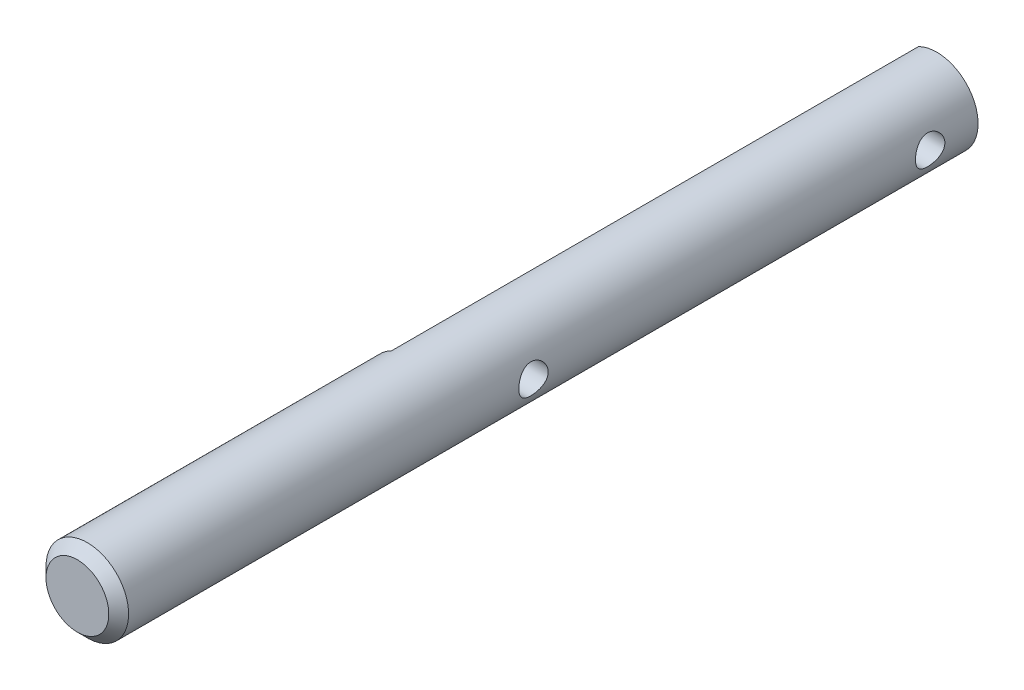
from build123d import *

# Parameters (mm, degrees)
SKETCH1_R               = 3.175
BOSS_EXTRUDE1_DEPTH     = 160.02
CHAMFER1_SIZE           = 0.762
CUT_EXTRUDE1_DEPTH      = 161.082983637
CUT_EXTRUDE1_DEPTH_BACK = 161.082983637
SKETCH2_R               = 1.1303
CUT_EXTRUDE2_START      = -3.175
SKETCH3_W               = 127
SKETCH3_H               = 6.35
CUT_EXTRUDE2_DEPTH      = 1.778
SKETCH4_R               = 3.175
CUT_EXTRUDE3_DEPTH      = 93.98


with BuildPart() as part:
    # Sketch1 → Boss-Extrude1 (new body)
    with BuildSketch(Plane.XY):
        Circle(SKETCH1_R)
    extrude(amount=BOSS_EXTRUDE1_DEPTH)

    # Chamfer1
    chamfer1_edges = [part.edges().sort_by_distance(p)[0] for p in [
        (-3.175, 0, 0),
        (-3.175, 0, 160.02),
    ]]
    chamfer(chamfer1_edges, length=CHAMFER1_SIZE)

    # Sketch2 → Cut-Extrude1 (cut, two sides: drawn at the far end of the back side and taken through both)
    with BuildSketch(Plane(origin=(0, 0, 0), x_dir=(0, 0, -1), z_dir=(1, 0, 0)).offset(-CUT_EXTRUDE1_DEPTH_BACK)):
        with Locations((-13.843, 0)):
            Circle(SKETCH2_R)
        with Locations((-44.323, 0)):
            Circle(SKETCH2_R)
        with Locations((-97.663, 0)):
            Circle(SKETCH2_R)
        with Locations((-128.143, 0)):
            Circle(SKETCH2_R)
    extrude(amount=CUT_EXTRUDE1_DEPTH + CUT_EXTRUDE1_DEPTH_BACK, mode=Mode.SUBTRACT)

    # Sketch3 → Cut-Extrude2 (cut)
    with BuildSketch(Plane(origin=(0, 0, 0), x_dir=(0, 0, -1), z_dir=(1, 0, 0)).offset(CUT_EXTRUDE2_START)):
        with Locations((-70.993, 0)):
            Rectangle(SKETCH3_W, SKETCH3_H)
    extrude(amount=CUT_EXTRUDE2_DEPTH, mode=Mode.SUBTRACT)

    # Sketch4 → Cut-Extrude3 (cut)
    with BuildSketch(Plane(origin=(0, 0, 0), x_dir=(-1, 0, 0), z_dir=(0, 0, -1))):
        Circle(SKETCH4_R)
    extrude(amount=-CUT_EXTRUDE3_DEPTH, mode=Mode.SUBTRACT)


solid = part.part
